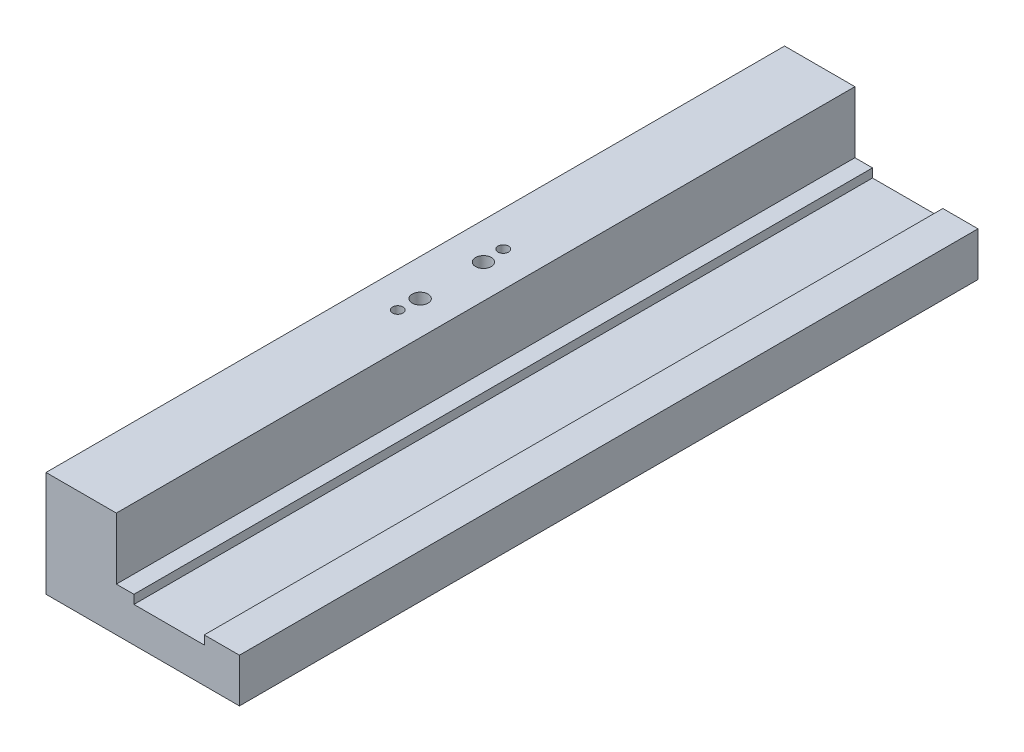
ISO-10303-21;
HEADER;
FILE_DESCRIPTION(('STEP AP214'),'2;1');
FILE_NAME('part.step','',(''),(''),'','','');
FILE_SCHEMA(('AUTOMOTIVE_DESIGN { 1 0 10303 214 1 1 1 1 }'));
ENDSEC;
DATA;
#1=APPLICATION_CONTEXT('core data for automotive mechanical design processes');
#2=APPLICATION_PROTOCOL_DEFINITION('international standard','automotive_design',2000,#1);
#3=PRODUCT_CONTEXT('',#1,'mechanical');
#4=PRODUCT('Part','Part','',(#3));
#5=PRODUCT_RELATED_PRODUCT_CATEGORY('part','',(#4));
#6=PRODUCT_DEFINITION_FORMATION('','',#4);
#7=PRODUCT_DEFINITION_CONTEXT('part definition',#1,'design');
#8=PRODUCT_DEFINITION('design','',#6,#7);
#9=PRODUCT_DEFINITION_SHAPE('','',#8);
#10=(LENGTH_UNIT() NAMED_UNIT(*) SI_UNIT(.MILLI.,.METRE.));
#11=(NAMED_UNIT(*) PLANE_ANGLE_UNIT() SI_UNIT($,.RADIAN.));
#12=(NAMED_UNIT(*) SI_UNIT($,.STERADIAN.) SOLID_ANGLE_UNIT());
#13=UNCERTAINTY_MEASURE_WITH_UNIT(LENGTH_MEASURE(1.E-05),#10,'distance_accuracy_value','');
#14=(GEOMETRIC_REPRESENTATION_CONTEXT(3) GLOBAL_UNCERTAINTY_ASSIGNED_CONTEXT((#13)) GLOBAL_UNIT_ASSIGNED_CONTEXT((#10,
#11,#12)) REPRESENTATION_CONTEXT('',''));
#15=CARTESIAN_POINT('',(0.,0.,0.));
#16=DIRECTION('',(0.,0.,1.));
#17=DIRECTION('',(1.,0.,0.));
#18=AXIS2_PLACEMENT_3D('',#15,#16,#17);
#19=CARTESIAN_POINT('',(0.,60.,420.));
#20=DIRECTION('',(1.,0.,0.));
#21=DIRECTION('',(0.,1.,0.));
#22=AXIS2_PLACEMENT_3D('',#19,#20,#21);
#23=PLANE('',#22);
#24=DIRECTION('',(0.,-1.,0.));
#25=VECTOR('',#24,1.);
#26=CARTESIAN_POINT('',(0.,60.,0.));
#27=LINE('',#26,#25);
#28=CARTESIAN_POINT('',(0.,60.,0.));
#29=VERTEX_POINT('',#28);
#30=CARTESIAN_POINT('',(0.,0.,0.));
#31=VERTEX_POINT('',#30);
#32=EDGE_CURVE('E147',#29,#31,#27,.T.);
#33=ORIENTED_EDGE('',*,*,#32,.T.);
#34=DIRECTION('',(0.,0.,-1.));
#35=VECTOR('',#34,1.);
#36=CARTESIAN_POINT('',(0.,0.,420.));
#37=LINE('',#36,#35);
#38=CARTESIAN_POINT('',(0.,0.,420.));
#39=VERTEX_POINT('',#38);
#40=EDGE_CURVE('E11',#39,#31,#37,.T.);
#41=ORIENTED_EDGE('',*,*,#40,.F.);
#42=DIRECTION('',(0.,-1.,0.));
#43=VECTOR('',#42,1.);
#44=CARTESIAN_POINT('',(0.,60.,420.));
#45=LINE('',#44,#43);
#46=CARTESIAN_POINT('',(0.,60.,420.));
#47=VERTEX_POINT('',#46);
#48=EDGE_CURVE('E166',#47,#39,#45,.T.);
#49=ORIENTED_EDGE('',*,*,#48,.F.);
#50=DIRECTION('',(0.,0.,-1.));
#51=VECTOR('',#50,1.);
#52=CARTESIAN_POINT('',(0.,60.,420.));
#53=LINE('',#52,#51);
#54=EDGE_CURVE('E143',#47,#29,#53,.T.);
#55=ORIENTED_EDGE('',*,*,#54,.T.);
#56=EDGE_LOOP('',(#33,#41,#49,#55));
#57=FACE_BOUND('',#56,.T.);
#58=ADVANCED_FACE('F39',(#57),#23,.F.);
#59=CARTESIAN_POINT('',(0.,0.,420.));
#60=DIRECTION('',(0.,1.,0.));
#61=DIRECTION('',(0.,0.,1.));
#62=AXIS2_PLACEMENT_3D('',#59,#60,#61);
#63=PLANE('',#62);
#64=CARTESIAN_POINT('',(20.7659537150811,0.,228.));
#65=DIRECTION('',(0.,-1.,0.));
#66=DIRECTION('',(0.,0.,-1.));
#67=AXIS2_PLACEMENT_3D('',#64,#65,#66);
#68=CIRCLE('',#67,7.5);
#69=CARTESIAN_POINT('',(20.7659537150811,0.,220.5));
#70=VERTEX_POINT('',#69);
#71=EDGE_CURVE('E245',#70,#70,#68,.T.);
#72=ORIENTED_EDGE('',*,*,#71,.F.);
#73=EDGE_LOOP('',(#72));
#74=FACE_BOUND('',#73,.T.);
#75=CARTESIAN_POINT('',(20.7659537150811,0.,192.));
#76=DIRECTION('',(0.,-1.,0.));
#77=DIRECTION('',(0.,0.,-1.));
#78=AXIS2_PLACEMENT_3D('',#75,#76,#77);
#79=CIRCLE('',#78,7.5);
#80=CARTESIAN_POINT('',(20.7659537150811,0.,184.5));
#81=VERTEX_POINT('',#80);
#82=EDGE_CURVE('E233',#81,#81,#79,.T.);
#83=ORIENTED_EDGE('',*,*,#82,.F.);
#84=EDGE_LOOP('',(#83));
#85=FACE_BOUND('',#84,.T.);
#86=CARTESIAN_POINT('',(20.,0.,180.));
#87=DIRECTION('',(0.,1.,0.));
#88=DIRECTION('',(0.,0.,1.));
#89=AXIS2_PLACEMENT_3D('',#86,#87,#88);
#90=CIRCLE('',#89,2.99999999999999);
#91=CARTESIAN_POINT('',(20.,0.,183.));
#92=VERTEX_POINT('',#91);
#93=EDGE_CURVE('E218',#92,#92,#90,.T.);
#94=ORIENTED_EDGE('',*,*,#93,.T.);
#95=EDGE_LOOP('',(#94));
#96=FACE_BOUND('',#95,.T.);
#97=CARTESIAN_POINT('',(20.,0.,240.));
#98=DIRECTION('',(0.,1.,0.));
#99=DIRECTION('',(0.,0.,1.));
#100=AXIS2_PLACEMENT_3D('',#97,#98,#99);
#101=CIRCLE('',#100,2.99999999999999);
#102=CARTESIAN_POINT('',(20.,0.,243.));
#103=VERTEX_POINT('',#102);
#104=EDGE_CURVE('E151',#103,#103,#101,.T.);
#105=ORIENTED_EDGE('',*,*,#104,.T.);
#106=EDGE_LOOP('',(#105));
#107=FACE_BOUND('',#106,.T.);
#108=DIRECTION('',(1.,0.,0.));
#109=VECTOR('',#108,1.);
#110=CARTESIAN_POINT('',(0.,0.,0.));
#111=LINE('',#110,#109);
#112=CARTESIAN_POINT('',(110.,0.,0.));
#113=VERTEX_POINT('',#112);
#114=EDGE_CURVE('E150',#31,#113,#111,.T.);
#115=ORIENTED_EDGE('',*,*,#114,.T.);
#116=DIRECTION('',(0.,0.,-1.));
#117=VECTOR('',#116,1.);
#118=CARTESIAN_POINT('',(110.,0.,420.));
#119=LINE('',#118,#117);
#120=CARTESIAN_POINT('',(110.,0.,420.));
#121=VERTEX_POINT('',#120);
#122=EDGE_CURVE('E47',#121,#113,#119,.T.);
#123=ORIENTED_EDGE('',*,*,#122,.F.);
#124=DIRECTION('',(1.,0.,0.));
#125=VECTOR('',#124,1.);
#126=CARTESIAN_POINT('',(0.,0.,420.));
#127=LINE('',#126,#125);
#128=EDGE_CURVE('E104',#39,#121,#127,.T.);
#129=ORIENTED_EDGE('',*,*,#128,.F.);
#130=ORIENTED_EDGE('',*,*,#40,.T.);
#131=EDGE_LOOP('',(#115,#123,#129,#130));
#132=FACE_BOUND('',#131,.T.);
#133=ADVANCED_FACE('F251',(#74,#85,#96,#107,#132),#63,.F.);
#134=CARTESIAN_POINT('',(110.,0.,420.));
#135=DIRECTION('',(-1.,0.,0.));
#136=DIRECTION('',(0.,0.,1.));
#137=AXIS2_PLACEMENT_3D('',#134,#135,#136);
#138=PLANE('',#137);
#139=DIRECTION('',(0.,1.,0.));
#140=VECTOR('',#139,1.);
#141=CARTESIAN_POINT('',(110.,0.,0.));
#142=LINE('',#141,#140);
#143=CARTESIAN_POINT('',(110.,25.,0.));
#144=VERTEX_POINT('',#143);
#145=EDGE_CURVE('E153',#113,#144,#142,.T.);
#146=ORIENTED_EDGE('',*,*,#145,.T.);
#147=DIRECTION('',(0.,0.,-1.));
#148=VECTOR('',#147,1.);
#149=CARTESIAN_POINT('',(110.,25.,420.));
#150=LINE('',#149,#148);
#151=CARTESIAN_POINT('',(110.,25.,420.));
#152=VERTEX_POINT('',#151);
#153=EDGE_CURVE('E179',#152,#144,#150,.T.);
#154=ORIENTED_EDGE('',*,*,#153,.F.);
#155=DIRECTION('',(0.,1.,0.));
#156=VECTOR('',#155,1.);
#157=CARTESIAN_POINT('',(110.,0.,420.));
#158=LINE('',#157,#156);
#159=EDGE_CURVE('E187',#121,#152,#158,.T.);
#160=ORIENTED_EDGE('',*,*,#159,.F.);
#161=ORIENTED_EDGE('',*,*,#122,.T.);
#162=EDGE_LOOP('',(#146,#154,#160,#161));
#163=FACE_BOUND('',#162,.T.);
#164=ADVANCED_FACE('F185',(#163),#138,.F.);
#165=CARTESIAN_POINT('',(110.,25.,420.));
#166=DIRECTION('',(0.,-1.,0.));
#167=DIRECTION('',(1.,0.,0.));
#168=AXIS2_PLACEMENT_3D('',#165,#166,#167);
#169=PLANE('',#168);
#170=DIRECTION('',(-1.,0.,0.));
#171=VECTOR('',#170,1.);
#172=CARTESIAN_POINT('',(110.,25.,0.));
#173=LINE('',#172,#171);
#174=CARTESIAN_POINT('',(90.,25.,0.));
#175=VERTEX_POINT('',#174);
#176=EDGE_CURVE('E155',#144,#175,#173,.T.);
#177=ORIENTED_EDGE('',*,*,#176,.T.);
#178=DIRECTION('',(0.,0.,-1.));
#179=VECTOR('',#178,1.);
#180=CARTESIAN_POINT('',(90.,25.,420.));
#181=LINE('',#180,#179);
#182=CARTESIAN_POINT('',(90.,25.,420.));
#183=VERTEX_POINT('',#182);
#184=EDGE_CURVE('E176',#183,#175,#181,.T.);
#185=ORIENTED_EDGE('',*,*,#184,.F.);
#186=DIRECTION('',(-1.,0.,0.));
#187=VECTOR('',#186,1.);
#188=CARTESIAN_POINT('',(110.,25.,420.));
#189=LINE('',#188,#187);
#190=EDGE_CURVE('E205',#152,#183,#189,.T.);
#191=ORIENTED_EDGE('',*,*,#190,.F.);
#192=ORIENTED_EDGE('',*,*,#153,.T.);
#193=EDGE_LOOP('',(#177,#185,#191,#192));
#194=FACE_BOUND('',#193,.T.);
#195=ADVANCED_FACE('F196',(#194),#169,.F.);
#196=CARTESIAN_POINT('',(90.,25.,420.));
#197=DIRECTION('',(1.,0.,0.));
#198=DIRECTION('',(0.,0.,-1.));
#199=AXIS2_PLACEMENT_3D('',#196,#197,#198);
#200=PLANE('',#199);
#201=DIRECTION('',(0.,-1.,0.));
#202=VECTOR('',#201,1.);
#203=CARTESIAN_POINT('',(90.,25.,0.));
#204=LINE('',#203,#202);
#205=CARTESIAN_POINT('',(90.,20.,0.));
#206=VERTEX_POINT('',#205);
#207=EDGE_CURVE('E157',#175,#206,#204,.T.);
#208=ORIENTED_EDGE('',*,*,#207,.T.);
#209=DIRECTION('',(0.,0.,-1.));
#210=VECTOR('',#209,1.);
#211=CARTESIAN_POINT('',(90.,20.,420.));
#212=LINE('',#211,#210);
#213=CARTESIAN_POINT('',(90.,20.,420.));
#214=VERTEX_POINT('',#213);
#215=EDGE_CURVE('E173',#214,#206,#212,.T.);
#216=ORIENTED_EDGE('',*,*,#215,.F.);
#217=DIRECTION('',(0.,-1.,0.));
#218=VECTOR('',#217,1.);
#219=CARTESIAN_POINT('',(90.,25.,420.));
#220=LINE('',#219,#218);
#221=EDGE_CURVE('E202',#183,#214,#220,.T.);
#222=ORIENTED_EDGE('',*,*,#221,.F.);
#223=ORIENTED_EDGE('',*,*,#184,.T.);
#224=EDGE_LOOP('',(#208,#216,#222,#223));
#225=FACE_BOUND('',#224,.T.);
#226=ADVANCED_FACE('F200',(#225),#200,.F.);
#227=CARTESIAN_POINT('',(90.,20.,420.));
#228=DIRECTION('',(0.,-1.,0.));
#229=DIRECTION('',(1.,0.,0.));
#230=AXIS2_PLACEMENT_3D('',#227,#228,#229);
#231=PLANE('',#230);
#232=DIRECTION('',(-1.,0.,0.));
#233=VECTOR('',#232,1.);
#234=CARTESIAN_POINT('',(90.,20.,0.));
#235=LINE('',#234,#233);
#236=CARTESIAN_POINT('',(50.,20.,0.));
#237=VERTEX_POINT('',#236);
#238=EDGE_CURVE('E159',#206,#237,#235,.T.);
#239=ORIENTED_EDGE('',*,*,#238,.T.);
#240=DIRECTION('',(0.,0.,-1.));
#241=VECTOR('',#240,1.);
#242=CARTESIAN_POINT('',(50.,20.,420.));
#243=LINE('',#242,#241);
#244=CARTESIAN_POINT('',(50.,20.,420.));
#245=VERTEX_POINT('',#244);
#246=EDGE_CURVE('E170',#245,#237,#243,.T.);
#247=ORIENTED_EDGE('',*,*,#246,.F.);
#248=DIRECTION('',(-1.,0.,0.));
#249=VECTOR('',#248,1.);
#250=CARTESIAN_POINT('',(90.,20.,420.));
#251=LINE('',#250,#249);
#252=EDGE_CURVE('E204',#214,#245,#251,.T.);
#253=ORIENTED_EDGE('',*,*,#252,.F.);
#254=ORIENTED_EDGE('',*,*,#215,.T.);
#255=EDGE_LOOP('',(#239,#247,#253,#254));
#256=FACE_BOUND('',#255,.T.);
#257=ADVANCED_FACE('F267',(#256),#231,.F.);
#258=CARTESIAN_POINT('',(50.,20.,420.));
#259=DIRECTION('',(-1.,0.,0.));
#260=DIRECTION('',(0.,0.,1.));
#261=AXIS2_PLACEMENT_3D('',#258,#259,#260);
#262=PLANE('',#261);
#263=DIRECTION('',(0.,1.,0.));
#264=VECTOR('',#263,1.);
#265=CARTESIAN_POINT('',(50.,20.,0.));
#266=LINE('',#265,#264);
#267=CARTESIAN_POINT('',(50.,25.,0.));
#268=VERTEX_POINT('',#267);
#269=EDGE_CURVE('E161',#237,#268,#266,.T.);
#270=ORIENTED_EDGE('',*,*,#269,.T.);
#271=DIRECTION('',(0.,0.,-1.));
#272=VECTOR('',#271,1.);
#273=CARTESIAN_POINT('',(50.,25.,420.));
#274=LINE('',#273,#272);
#275=CARTESIAN_POINT('',(50.,25.,420.));
#276=VERTEX_POINT('',#275);
#277=EDGE_CURVE('E138',#276,#268,#274,.T.);
#278=ORIENTED_EDGE('',*,*,#277,.F.);
#279=DIRECTION('',(0.,1.,0.));
#280=VECTOR('',#279,1.);
#281=CARTESIAN_POINT('',(50.,20.,420.));
#282=LINE('',#281,#280);
#283=EDGE_CURVE('E129',#245,#276,#282,.T.);
#284=ORIENTED_EDGE('',*,*,#283,.F.);
#285=ORIENTED_EDGE('',*,*,#246,.T.);
#286=EDGE_LOOP('',(#270,#278,#284,#285));
#287=FACE_BOUND('',#286,.T.);
#288=ADVANCED_FACE('F264',(#287),#262,.F.);
#289=CARTESIAN_POINT('',(50.,25.,420.));
#290=DIRECTION('',(0.,-1.,0.));
#291=DIRECTION('',(0.,0.,-1.));
#292=AXIS2_PLACEMENT_3D('',#289,#290,#291);
#293=PLANE('',#292);
#294=DIRECTION('',(-1.,0.,0.));
#295=VECTOR('',#294,1.);
#296=CARTESIAN_POINT('',(50.,25.,0.));
#297=LINE('',#296,#295);
#298=CARTESIAN_POINT('',(40.,25.,0.));
#299=VERTEX_POINT('',#298);
#300=EDGE_CURVE('E137',#268,#299,#297,.T.);
#301=ORIENTED_EDGE('',*,*,#300,.T.);
#302=DIRECTION('',(0.,0.,-1.));
#303=VECTOR('',#302,1.);
#304=CARTESIAN_POINT('',(40.,25.,420.));
#305=LINE('',#304,#303);
#306=CARTESIAN_POINT('',(40.,25.,420.));
#307=VERTEX_POINT('',#306);
#308=EDGE_CURVE('E134',#307,#299,#305,.T.);
#309=ORIENTED_EDGE('',*,*,#308,.F.);
#310=DIRECTION('',(-1.,0.,0.));
#311=VECTOR('',#310,1.);
#312=CARTESIAN_POINT('',(50.,25.,420.));
#313=LINE('',#312,#311);
#314=EDGE_CURVE('E123',#276,#307,#313,.T.);
#315=ORIENTED_EDGE('',*,*,#314,.F.);
#316=ORIENTED_EDGE('',*,*,#277,.T.);
#317=EDGE_LOOP('',(#301,#309,#315,#316));
#318=FACE_BOUND('',#317,.T.);
#319=ADVANCED_FACE('F135',(#318),#293,.F.);
#320=CARTESIAN_POINT('',(40.,25.,420.));
#321=DIRECTION('',(-1.,0.,0.));
#322=DIRECTION('',(0.,0.,1.));
#323=AXIS2_PLACEMENT_3D('',#320,#321,#322);
#324=PLANE('',#323);
#325=DIRECTION('',(0.,1.,0.));
#326=VECTOR('',#325,1.);
#327=CARTESIAN_POINT('',(40.,25.,0.));
#328=LINE('',#327,#326);
#329=CARTESIAN_POINT('',(40.,60.,0.));
#330=VERTEX_POINT('',#329);
#331=EDGE_CURVE('E90',#299,#330,#328,.T.);
#332=ORIENTED_EDGE('',*,*,#331,.T.);
#333=DIRECTION('',(0.,0.,-1.));
#334=VECTOR('',#333,1.);
#335=CARTESIAN_POINT('',(40.,60.,420.));
#336=LINE('',#335,#334);
#337=CARTESIAN_POINT('',(40.,60.,420.));
#338=VERTEX_POINT('',#337);
#339=EDGE_CURVE('E139',#338,#330,#336,.T.);
#340=ORIENTED_EDGE('',*,*,#339,.F.);
#341=DIRECTION('',(0.,1.,0.));
#342=VECTOR('',#341,1.);
#343=CARTESIAN_POINT('',(40.,25.,420.));
#344=LINE('',#343,#342);
#345=EDGE_CURVE('E127',#307,#338,#344,.T.);
#346=ORIENTED_EDGE('',*,*,#345,.F.);
#347=ORIENTED_EDGE('',*,*,#308,.T.);
#348=EDGE_LOOP('',(#332,#340,#346,#347));
#349=FACE_BOUND('',#348,.T.);
#350=ADVANCED_FACE('F141',(#349),#324,.F.);
#351=CARTESIAN_POINT('',(40.,60.,420.));
#352=DIRECTION('',(0.,-1.,0.));
#353=DIRECTION('',(1.,0.,0.));
#354=AXIS2_PLACEMENT_3D('',#351,#352,#353);
#355=PLANE('',#354);
#356=CARTESIAN_POINT('',(20.7659537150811,60.,228.));
#357=DIRECTION('',(0.,-1.,0.));
#358=DIRECTION('',(0.,0.,-1.));
#359=AXIS2_PLACEMENT_3D('',#356,#357,#358);
#360=CIRCLE('',#359,4.5);
#361=CARTESIAN_POINT('',(20.7659537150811,60.,223.5));
#362=VERTEX_POINT('',#361);
#363=EDGE_CURVE('E236',#362,#362,#360,.T.);
#364=ORIENTED_EDGE('',*,*,#363,.T.);
#365=EDGE_LOOP('',(#364));
#366=FACE_BOUND('',#365,.T.);
#367=CARTESIAN_POINT('',(20.7659537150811,60.,192.));
#368=DIRECTION('',(0.,-1.,0.));
#369=DIRECTION('',(0.,0.,-1.));
#370=AXIS2_PLACEMENT_3D('',#367,#368,#369);
#371=CIRCLE('',#370,4.5);
#372=CARTESIAN_POINT('',(20.7659537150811,60.,187.5));
#373=VERTEX_POINT('',#372);
#374=EDGE_CURVE('E224',#373,#373,#371,.T.);
#375=ORIENTED_EDGE('',*,*,#374,.T.);
#376=EDGE_LOOP('',(#375));
#377=FACE_BOUND('',#376,.T.);
#378=CARTESIAN_POINT('',(20.,60.,180.));
#379=DIRECTION('',(0.,1.,0.));
#380=DIRECTION('',(0.,0.,1.));
#381=AXIS2_PLACEMENT_3D('',#378,#379,#380);
#382=CIRCLE('',#381,2.99999999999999);
#383=CARTESIAN_POINT('',(20.,60.,183.));
#384=VERTEX_POINT('',#383);
#385=EDGE_CURVE('E221',#384,#384,#382,.T.);
#386=ORIENTED_EDGE('',*,*,#385,.F.);
#387=EDGE_LOOP('',(#386));
#388=FACE_BOUND('',#387,.T.);
#389=CARTESIAN_POINT('',(20.,60.,240.));
#390=DIRECTION('',(0.,1.,0.));
#391=DIRECTION('',(0.,0.,1.));
#392=AXIS2_PLACEMENT_3D('',#389,#390,#391);
#393=CIRCLE('',#392,2.99999999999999);
#394=CARTESIAN_POINT('',(20.,60.,243.));
#395=VERTEX_POINT('',#394);
#396=EDGE_CURVE('E215',#395,#395,#393,.T.);
#397=ORIENTED_EDGE('',*,*,#396,.F.);
#398=EDGE_LOOP('',(#397));
#399=FACE_BOUND('',#398,.T.);
#400=DIRECTION('',(-1.,0.,0.));
#401=VECTOR('',#400,1.);
#402=CARTESIAN_POINT('',(40.,60.,0.));
#403=LINE('',#402,#401);
#404=EDGE_CURVE('E96',#330,#29,#403,.T.);
#405=ORIENTED_EDGE('',*,*,#404,.T.);
#406=ORIENTED_EDGE('',*,*,#54,.F.);
#407=DIRECTION('',(-1.,0.,0.));
#408=VECTOR('',#407,1.);
#409=CARTESIAN_POINT('',(40.,60.,420.));
#410=LINE('',#409,#408);
#411=EDGE_CURVE('E55',#338,#47,#410,.T.);
#412=ORIENTED_EDGE('',*,*,#411,.F.);
#413=ORIENTED_EDGE('',*,*,#339,.T.);
#414=EDGE_LOOP('',(#405,#406,#412,#413));
#415=FACE_BOUND('',#414,.T.);
#416=ADVANCED_FACE('F328',(#366,#377,#388,#399,#415),#355,.F.);
#417=CARTESIAN_POINT('',(0.,0.,420.));
#418=DIRECTION('',(0.,0.,1.));
#419=DIRECTION('',(1.,0.,0.));
#420=AXIS2_PLACEMENT_3D('',#417,#418,#419);
#421=PLANE('',#420);
#422=ORIENTED_EDGE('',*,*,#48,.T.);
#423=ORIENTED_EDGE('',*,*,#128,.T.);
#424=ORIENTED_EDGE('',*,*,#159,.T.);
#425=ORIENTED_EDGE('',*,*,#190,.T.);
#426=ORIENTED_EDGE('',*,*,#221,.T.);
#427=ORIENTED_EDGE('',*,*,#252,.T.);
#428=ORIENTED_EDGE('',*,*,#283,.T.);
#429=ORIENTED_EDGE('',*,*,#314,.T.);
#430=ORIENTED_EDGE('',*,*,#345,.T.);
#431=ORIENTED_EDGE('',*,*,#411,.T.);
#432=EDGE_LOOP('',(#422,#423,#424,#425,#426,#427,#428,#429,#430,#431));
#433=FACE_BOUND('',#432,.T.);
#434=ADVANCED_FACE('F125',(#433),#421,.T.);
#435=CARTESIAN_POINT('',(0.,0.,0.));
#436=DIRECTION('',(0.,0.,1.));
#437=DIRECTION('',(1.,0.,0.));
#438=AXIS2_PLACEMENT_3D('',#435,#436,#437);
#439=PLANE('',#438);
#440=ORIENTED_EDGE('',*,*,#32,.F.);
#441=ORIENTED_EDGE('',*,*,#404,.F.);
#442=ORIENTED_EDGE('',*,*,#331,.F.);
#443=ORIENTED_EDGE('',*,*,#300,.F.);
#444=ORIENTED_EDGE('',*,*,#269,.F.);
#445=ORIENTED_EDGE('',*,*,#238,.F.);
#446=ORIENTED_EDGE('',*,*,#207,.F.);
#447=ORIENTED_EDGE('',*,*,#176,.F.);
#448=ORIENTED_EDGE('',*,*,#145,.F.);
#449=ORIENTED_EDGE('',*,*,#114,.F.);
#450=EDGE_LOOP('',(#440,#441,#442,#443,#444,#445,#446,#447,#448,#449));
#451=FACE_BOUND('',#450,.T.);
#452=ADVANCED_FACE('F191',(#451),#439,.F.);
#453=CARTESIAN_POINT('',(20.,60.,240.));
#454=DIRECTION('',(0.,1.,0.));
#455=DIRECTION('',(0.,0.,1.));
#456=AXIS2_PLACEMENT_3D('',#453,#454,#455);
#457=CYLINDRICAL_SURFACE('',#456,2.99999999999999);
#458=ORIENTED_EDGE('',*,*,#104,.F.);
#459=EDGE_LOOP('',(#458));
#460=FACE_BOUND('',#459,.T.);
#461=ORIENTED_EDGE('',*,*,#396,.T.);
#462=EDGE_LOOP('',(#461));
#463=FACE_BOUND('',#462,.T.);
#464=ADVANCED_FACE('F347',(#460,#463),#457,.F.);
#465=CARTESIAN_POINT('',(20.,60.,180.));
#466=DIRECTION('',(0.,1.,0.));
#467=DIRECTION('',(0.,0.,1.));
#468=AXIS2_PLACEMENT_3D('',#465,#466,#467);
#469=CYLINDRICAL_SURFACE('',#468,2.99999999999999);
#470=ORIENTED_EDGE('',*,*,#93,.F.);
#471=EDGE_LOOP('',(#470));
#472=FACE_BOUND('',#471,.T.);
#473=ORIENTED_EDGE('',*,*,#385,.T.);
#474=EDGE_LOOP('',(#473));
#475=FACE_BOUND('',#474,.T.);
#476=ADVANCED_FACE('F355',(#472,#475),#469,.F.);
#477=CARTESIAN_POINT('',(20.7659537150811,0.,192.));
#478=DIRECTION('',(0.,-1.,0.));
#479=DIRECTION('',(0.,0.,-1.));
#480=AXIS2_PLACEMENT_3D('',#477,#478,#479);
#481=CYLINDRICAL_SURFACE('',#480,4.50000000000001);
#482=ORIENTED_EDGE('',*,*,#374,.F.);
#483=EDGE_LOOP('',(#482));
#484=FACE_BOUND('',#483,.T.);
#485=CARTESIAN_POINT('',(20.7659537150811,8.99999999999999,192.));
#486=DIRECTION('',(0.,-1.,0.));
#487=DIRECTION('',(0.,0.,-1.));
#488=AXIS2_PLACEMENT_3D('',#485,#486,#487);
#489=CIRCLE('',#488,4.50000000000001);
#490=CARTESIAN_POINT('',(20.7659537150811,8.99999999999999,187.5));
#491=VERTEX_POINT('',#490);
#492=EDGE_CURVE('E227',#491,#491,#489,.T.);
#493=ORIENTED_EDGE('',*,*,#492,.T.);
#494=EDGE_LOOP('',(#493));
#495=FACE_BOUND('',#494,.T.);
#496=ADVANCED_FACE('F364',(#484,#495),#481,.F.);
#497=CARTESIAN_POINT('',(25.2659537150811,9.,192.));
#498=DIRECTION('',(0.,1.,0.));
#499=DIRECTION('',(0.,0.,1.));
#500=AXIS2_PLACEMENT_3D('',#497,#498,#499);
#501=PLANE('',#500);
#502=ORIENTED_EDGE('',*,*,#492,.F.);
#503=EDGE_LOOP('',(#502));
#504=FACE_BOUND('',#503,.T.);
#505=CARTESIAN_POINT('',(20.7659537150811,9.,192.));
#506=DIRECTION('',(0.,-1.,0.));
#507=DIRECTION('',(0.,0.,-1.));
#508=AXIS2_PLACEMENT_3D('',#505,#506,#507);
#509=CIRCLE('',#508,7.5);
#510=CARTESIAN_POINT('',(20.7659537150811,9.,184.5));
#511=VERTEX_POINT('',#510);
#512=EDGE_CURVE('E230',#511,#511,#509,.T.);
#513=ORIENTED_EDGE('',*,*,#512,.T.);
#514=EDGE_LOOP('',(#513));
#515=FACE_BOUND('',#514,.T.);
#516=ADVANCED_FACE('F375',(#504,#515),#501,.F.);
#517=CARTESIAN_POINT('',(20.7659537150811,0.,192.));
#518=DIRECTION('',(0.,-1.,0.));
#519=DIRECTION('',(0.,0.,-1.));
#520=AXIS2_PLACEMENT_3D('',#517,#518,#519);
#521=CYLINDRICAL_SURFACE('',#520,7.5);
#522=ORIENTED_EDGE('',*,*,#512,.F.);
#523=EDGE_LOOP('',(#522));
#524=FACE_BOUND('',#523,.T.);
#525=ORIENTED_EDGE('',*,*,#82,.T.);
#526=EDGE_LOOP('',(#525));
#527=FACE_BOUND('',#526,.T.);
#528=ADVANCED_FACE('F382',(#524,#527),#521,.F.);
#529=CARTESIAN_POINT('',(20.7659537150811,0.,228.));
#530=DIRECTION('',(0.,-1.,0.));
#531=DIRECTION('',(0.,0.,-1.));
#532=AXIS2_PLACEMENT_3D('',#529,#530,#531);
#533=CYLINDRICAL_SURFACE('',#532,4.50000000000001);
#534=ORIENTED_EDGE('',*,*,#363,.F.);
#535=EDGE_LOOP('',(#534));
#536=FACE_BOUND('',#535,.T.);
#537=CARTESIAN_POINT('',(20.7659537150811,8.99999999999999,228.));
#538=DIRECTION('',(0.,-1.,0.));
#539=DIRECTION('',(0.,0.,-1.));
#540=AXIS2_PLACEMENT_3D('',#537,#538,#539);
#541=CIRCLE('',#540,4.50000000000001);
#542=CARTESIAN_POINT('',(20.7659537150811,8.99999999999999,223.5));
#543=VERTEX_POINT('',#542);
#544=EDGE_CURVE('E239',#543,#543,#541,.T.);
#545=ORIENTED_EDGE('',*,*,#544,.T.);
#546=EDGE_LOOP('',(#545));
#547=FACE_BOUND('',#546,.T.);
#548=ADVANCED_FACE('F390',(#536,#547),#533,.F.);
#549=CARTESIAN_POINT('',(25.2659537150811,9.,228.));
#550=DIRECTION('',(0.,1.,0.));
#551=DIRECTION('',(0.,0.,1.));
#552=AXIS2_PLACEMENT_3D('',#549,#550,#551);
#553=PLANE('',#552);
#554=ORIENTED_EDGE('',*,*,#544,.F.);
#555=EDGE_LOOP('',(#554));
#556=FACE_BOUND('',#555,.T.);
#557=CARTESIAN_POINT('',(20.7659537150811,9.,228.));
#558=DIRECTION('',(0.,-1.,0.));
#559=DIRECTION('',(0.,0.,-1.));
#560=AXIS2_PLACEMENT_3D('',#557,#558,#559);
#561=CIRCLE('',#560,7.5);
#562=CARTESIAN_POINT('',(20.7659537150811,9.,220.5));
#563=VERTEX_POINT('',#562);
#564=EDGE_CURVE('E242',#563,#563,#561,.T.);
#565=ORIENTED_EDGE('',*,*,#564,.T.);
#566=EDGE_LOOP('',(#565));
#567=FACE_BOUND('',#566,.T.);
#568=ADVANCED_FACE('F398',(#556,#567),#553,.F.);
#569=CARTESIAN_POINT('',(20.7659537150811,0.,228.));
#570=DIRECTION('',(0.,-1.,0.));
#571=DIRECTION('',(0.,0.,-1.));
#572=AXIS2_PLACEMENT_3D('',#569,#570,#571);
#573=CYLINDRICAL_SURFACE('',#572,7.5);
#574=ORIENTED_EDGE('',*,*,#564,.F.);
#575=EDGE_LOOP('',(#574));
#576=FACE_BOUND('',#575,.T.);
#577=ORIENTED_EDGE('',*,*,#71,.T.);
#578=EDGE_LOOP('',(#577));
#579=FACE_BOUND('',#578,.T.);
#580=ADVANCED_FACE('F249',(#576,#579),#573,.F.);
#581=CLOSED_SHELL('',(#58,#133,#164,#195,#226,#257,#288,#319,#350,#416,#434,#452,#464,#476,#496,
#516,#528,#548,#568,#580));
#582=MANIFOLD_SOLID_BREP('B2',#581);
#583=ADVANCED_BREP_SHAPE_REPRESENTATION('',(#18,#582),#14);
#584=SHAPE_DEFINITION_REPRESENTATION(#9,#583);
ENDSEC;
END-ISO-10303-21;
